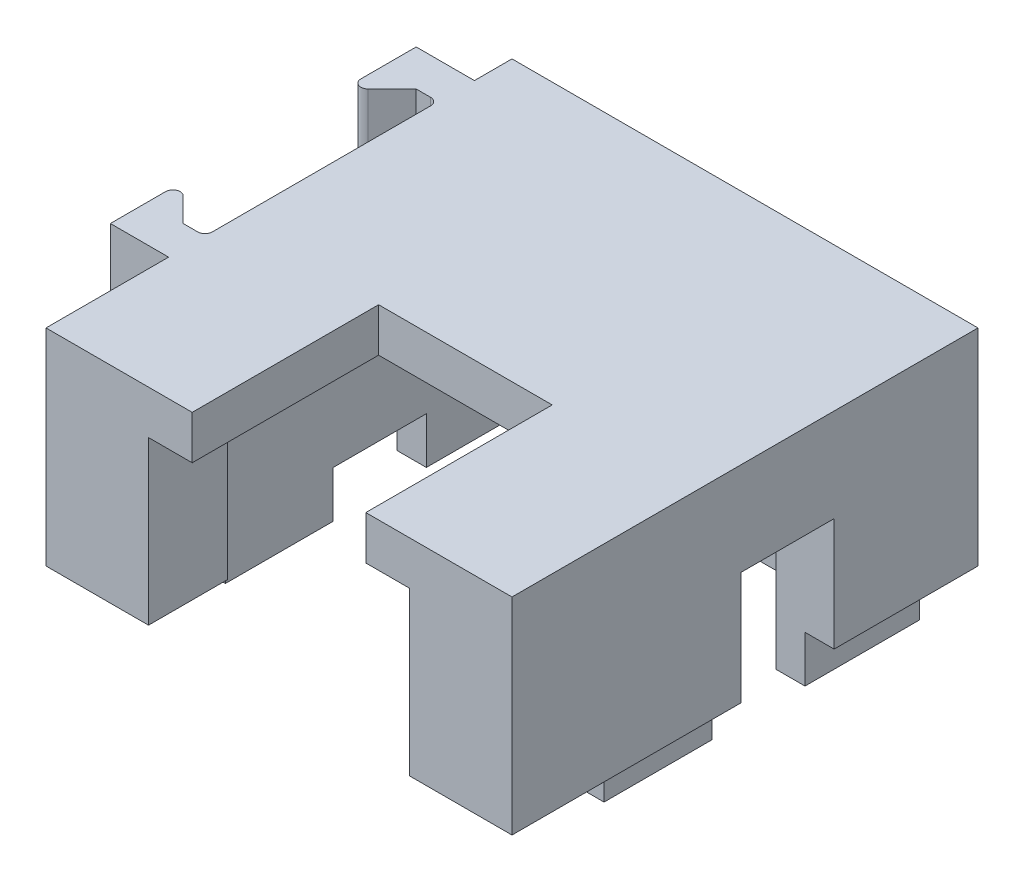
ISO-10303-21;
HEADER;
FILE_DESCRIPTION(('STEP AP214'),'2;1');
FILE_NAME('part.step','',(''),(''),'','','');
FILE_SCHEMA(('AUTOMOTIVE_DESIGN { 1 0 10303 214 1 1 1 1 }'));
ENDSEC;
DATA;
#1=APPLICATION_CONTEXT('core data for automotive mechanical design processes');
#2=APPLICATION_PROTOCOL_DEFINITION('international standard','automotive_design',2000,#1);
#3=PRODUCT_CONTEXT('',#1,'mechanical');
#4=PRODUCT('Part','Part','',(#3));
#5=PRODUCT_RELATED_PRODUCT_CATEGORY('part','',(#4));
#6=PRODUCT_DEFINITION_FORMATION('','',#4);
#7=PRODUCT_DEFINITION_CONTEXT('part definition',#1,'design');
#8=PRODUCT_DEFINITION('design','',#6,#7);
#9=PRODUCT_DEFINITION_SHAPE('','',#8);
#10=(LENGTH_UNIT() NAMED_UNIT(*) SI_UNIT(.MILLI.,.METRE.));
#11=(NAMED_UNIT(*) PLANE_ANGLE_UNIT() SI_UNIT($,.RADIAN.));
#12=(NAMED_UNIT(*) SI_UNIT($,.STERADIAN.) SOLID_ANGLE_UNIT());
#13=UNCERTAINTY_MEASURE_WITH_UNIT(LENGTH_MEASURE(1.E-05),#10,'distance_accuracy_value','');
#14=(GEOMETRIC_REPRESENTATION_CONTEXT(3) GLOBAL_UNCERTAINTY_ASSIGNED_CONTEXT((#13)) GLOBAL_UNIT_ASSIGNED_CONTEXT((#10,
#11,#12)) REPRESENTATION_CONTEXT('',''));
#15=CARTESIAN_POINT('',(0.,0.,0.));
#16=DIRECTION('',(0.,0.,1.));
#17=DIRECTION('',(1.,0.,0.));
#18=AXIS2_PLACEMENT_3D('',#15,#16,#17);
#19=CARTESIAN_POINT('',(-13.890625,16.3219798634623,-8.66775));
#20=DIRECTION('',(0.,0.,1.));
#21=DIRECTION('',(1.,0.,0.));
#22=AXIS2_PLACEMENT_3D('',#19,#20,#21);
#23=PLANE('',#22);
#24=CARTESIAN_POINT('',(-14.2875,5.74675,-8.66775));
#25=DIRECTION('',(0.,0.,1.));
#26=DIRECTION('',(1.,0.,0.));
#27=AXIS2_PLACEMENT_3D('',#24,#25,#26);
#28=CIRCLE('',#27,0.595629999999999);
#29=CARTESIAN_POINT('',(-13.890625,5.30260438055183,-8.66775));
#30=VERTEX_POINT('',#29);
#31=CARTESIAN_POINT('',(-13.890625,6.19089561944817,-8.66775));
#32=VERTEX_POINT('',#31);
#33=EDGE_CURVE('E61',#30,#32,#28,.T.);
#34=ORIENTED_EDGE('',*,*,#33,.F.);
#35=DIRECTION('',(0.,-1.,0.));
#36=VECTOR('',#35,1.);
#37=CARTESIAN_POINT('',(-13.890625,16.3219798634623,-8.66775));
#38=LINE('',#37,#36);
#39=CARTESIAN_POINT('',(-13.890625,0.254000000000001,-8.66775));
#40=VERTEX_POINT('',#39);
#41=EDGE_CURVE('E351',#30,#40,#38,.T.);
#42=ORIENTED_EDGE('',*,*,#41,.T.);
#43=DIRECTION('',(1.,0.,0.));
#44=VECTOR('',#43,1.);
#45=CARTESIAN_POINT('',(-13.890625,0.254000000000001,-8.66775));
#46=LINE('',#45,#44);
#47=CARTESIAN_POINT('',(-13.096875,0.254000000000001,-8.66775));
#48=VERTEX_POINT('',#47);
#49=EDGE_CURVE('E851',#40,#48,#46,.T.);
#50=ORIENTED_EDGE('',*,*,#49,.T.);
#51=DIRECTION('',(0.,-1.,0.));
#52=VECTOR('',#51,1.);
#53=CARTESIAN_POINT('',(-13.096875,16.3219798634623,-8.66775));
#54=LINE('',#53,#52);
#55=CARTESIAN_POINT('',(-13.096875,11.2395,-8.66775));
#56=VERTEX_POINT('',#55);
#57=EDGE_CURVE('E842',#48,#56,#54,.F.);
#58=ORIENTED_EDGE('',*,*,#57,.T.);
#59=DIRECTION('',(-1.,0.,0.));
#60=VECTOR('',#59,1.);
#61=CARTESIAN_POINT('',(-13.890625,11.2395,-8.66775));
#62=LINE('',#61,#60);
#63=CARTESIAN_POINT('',(-13.890625,11.2395,-8.66775));
#64=VERTEX_POINT('',#63);
#65=EDGE_CURVE('E361',#56,#64,#62,.T.);
#66=ORIENTED_EDGE('',*,*,#65,.T.);
#67=EDGE_CURVE('E353',#64,#32,#38,.T.);
#68=ORIENTED_EDGE('',*,*,#67,.T.);
#69=EDGE_LOOP('',(#34,#42,#50,#58,#66,#68));
#70=FACE_BOUND('',#69,.T.);
#71=ADVANCED_FACE('F48',(#70),#23,.T.);
#72=CARTESIAN_POINT('',(-15.875,16.3219798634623,-6.68337499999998));
#73=DIRECTION('',(0.707106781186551,0.,0.707106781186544));
#74=DIRECTION('',(0.707106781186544,0.,-0.707106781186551));
#75=AXIS2_PLACEMENT_3D('',#72,#73,#74);
#76=PLANE('',#75);
#77=CARTESIAN_POINT('',(-14.2875,5.74675,-8.270875));
#78=DIRECTION('',(0.707106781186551,0.,0.707106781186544));
#79=DIRECTION('',(0.707106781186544,0.,-0.707106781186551));
#80=AXIS2_PLACEMENT_3D('',#77,#78,#79);
#81=ELLIPSE('',#80,0.84234802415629,0.595629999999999);
#82=EDGE_CURVE('E13',#32,#30,#81,.T.);
#83=ORIENTED_EDGE('',*,*,#82,.F.);
#84=ORIENTED_EDGE('',*,*,#67,.F.);
#85=DIRECTION('',(-0.707106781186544,0.,0.707106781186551));
#86=VECTOR('',#85,1.);
#87=CARTESIAN_POINT('',(-15.875,11.2395,-6.68337499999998));
#88=LINE('',#87,#86);
#89=CARTESIAN_POINT('',(-15.1974919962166,11.2395,-7.3608830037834));
#90=VERTEX_POINT('',#89);
#91=EDGE_CURVE('E363',#64,#90,#88,.T.);
#92=ORIENTED_EDGE('',*,*,#91,.T.);
#93=DIRECTION('',(0.,-1.,0.));
#94=VECTOR('',#93,1.);
#95=CARTESIAN_POINT('',(-15.1974919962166,16.3219798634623,-7.3608830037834));
#96=LINE('',#95,#94);
#97=CARTESIAN_POINT('',(-15.1974919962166,0.254000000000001,-7.3608830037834));
#98=VERTEX_POINT('',#97);
#99=EDGE_CURVE('E673',#90,#98,#96,.T.);
#100=ORIENTED_EDGE('',*,*,#99,.T.);
#101=DIRECTION('',(0.707106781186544,0.,-0.707106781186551));
#102=VECTOR('',#101,1.);
#103=CARTESIAN_POINT('',(-15.875,0.254000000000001,-6.68337499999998));
#104=LINE('',#103,#102);
#105=EDGE_CURVE('E360',#98,#40,#104,.T.);
#106=ORIENTED_EDGE('',*,*,#105,.T.);
#107=ORIENTED_EDGE('',*,*,#41,.F.);
#108=EDGE_LOOP('',(#83,#84,#92,#100,#106,#107));
#109=FACE_BOUND('',#108,.T.);
#110=ADVANCED_FACE('F358',(#109),#76,.T.);
#111=CARTESIAN_POINT('',(-15.875,16.3219798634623,-10.652125));
#112=DIRECTION('',(-1.,0.,0.));
#113=DIRECTION('',(0.,0.,1.));
#114=AXIS2_PLACEMENT_3D('',#111,#112,#113);
#115=PLANE('',#114);
#116=DIRECTION('',(0.,-1.,0.));
#117=VECTOR('',#116,1.);
#118=CARTESIAN_POINT('',(-15.875,16.3219798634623,-10.652125));
#119=LINE('',#118,#117);
#120=CARTESIAN_POINT('',(-15.875,11.2395,-10.652125));
#121=VERTEX_POINT('',#120);
#122=CARTESIAN_POINT('',(-15.875,0.254,-10.652125));
#123=VERTEX_POINT('',#122);
#124=EDGE_CURVE('E368',#121,#123,#119,.T.);
#125=ORIENTED_EDGE('',*,*,#124,.T.);
#126=DIRECTION('',(0.,0.,-1.));
#127=VECTOR('',#126,1.);
#128=CARTESIAN_POINT('',(-15.875,0.254,-10.652125));
#129=LINE('',#128,#127);
#130=CARTESIAN_POINT('',(-15.875,0.254000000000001,-7.64151600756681));
#131=VERTEX_POINT('',#130);
#132=EDGE_CURVE('E1374',#131,#123,#129,.T.);
#133=ORIENTED_EDGE('',*,*,#132,.F.);
#134=DIRECTION('',(0.,-1.,0.));
#135=VECTOR('',#134,1.);
#136=CARTESIAN_POINT('',(-15.875,16.3219798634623,-7.64151600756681));
#137=LINE('',#136,#135);
#138=CARTESIAN_POINT('',(-15.875,11.2395,-7.64151600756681));
#139=VERTEX_POINT('',#138);
#140=EDGE_CURVE('E832',#131,#139,#137,.F.);
#141=ORIENTED_EDGE('',*,*,#140,.T.);
#142=DIRECTION('',(0.,0.,-1.));
#143=VECTOR('',#142,1.);
#144=CARTESIAN_POINT('',(-15.875,11.2395,-10.652125));
#145=LINE('',#144,#143);
#146=EDGE_CURVE('E819',#139,#121,#145,.T.);
#147=ORIENTED_EDGE('',*,*,#146,.T.);
#148=EDGE_LOOP('',(#125,#133,#141,#147));
#149=FACE_BOUND('',#148,.T.);
#150=ADVANCED_FACE('F961',(#149),#115,.T.);
#151=CARTESIAN_POINT('',(-12.7,16.3219798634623,-10.652125));
#152=DIRECTION('',(0.,0.,-1.));
#153=DIRECTION('',(-1.,0.,0.));
#154=AXIS2_PLACEMENT_3D('',#151,#152,#153);
#155=PLANE('',#154);
#156=CARTESIAN_POINT('',(-14.2875,5.74675,-10.652125));
#157=DIRECTION('',(0.,0.,-1.));
#158=DIRECTION('',(-1.,0.,0.));
#159=AXIS2_PLACEMENT_3D('',#156,#157,#158);
#160=CIRCLE('',#159,0.59563);
#161=CARTESIAN_POINT('',(-14.88313,5.74675,-10.652125));
#162=VERTEX_POINT('',#161);
#163=EDGE_CURVE('E355',#162,#162,#160,.T.);
#164=ORIENTED_EDGE('',*,*,#163,.F.);
#165=EDGE_LOOP('',(#164));
#166=FACE_BOUND('',#165,.T.);
#167=DIRECTION('',(0.,-1.,0.));
#168=VECTOR('',#167,1.);
#169=CARTESIAN_POINT('',(-12.7,16.3219798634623,-10.652125));
#170=LINE('',#169,#168);
#171=CARTESIAN_POINT('',(-12.7,11.2395,-10.652125));
#172=VERTEX_POINT('',#171);
#173=CARTESIAN_POINT('',(-12.7,0.254,-10.652125));
#174=VERTEX_POINT('',#173);
#175=EDGE_CURVE('E387',#172,#174,#170,.T.);
#176=ORIENTED_EDGE('',*,*,#175,.T.);
#177=DIRECTION('',(1.,0.,0.));
#178=VECTOR('',#177,1.);
#179=CARTESIAN_POINT('',(-12.7,0.254,-10.652125));
#180=LINE('',#179,#178);
#181=EDGE_CURVE('E1377',#123,#174,#180,.T.);
#182=ORIENTED_EDGE('',*,*,#181,.F.);
#183=ORIENTED_EDGE('',*,*,#124,.F.);
#184=DIRECTION('',(1.,0.,0.));
#185=VECTOR('',#184,1.);
#186=CARTESIAN_POINT('',(-12.7,11.2395,-10.652125));
#187=LINE('',#186,#185);
#188=EDGE_CURVE('E826',#121,#172,#187,.T.);
#189=ORIENTED_EDGE('',*,*,#188,.T.);
#190=EDGE_LOOP('',(#176,#182,#183,#189));
#191=FACE_BOUND('',#190,.T.);
#192=ADVANCED_FACE('F1038',(#166,#191),#155,.T.);
#193=CARTESIAN_POINT('',(-15.478125,16.3219798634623,-7.64151600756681));
#194=DIRECTION('',(0.,-1.,0.));
#195=DIRECTION('',(0.,0.,-1.));
#196=AXIS2_PLACEMENT_3D('',#193,#194,#195);
#197=CYLINDRICAL_SURFACE('',#196,0.396875);
#198=ORIENTED_EDGE('',*,*,#140,.F.);
#199=CARTESIAN_POINT('',(-15.478125,0.254000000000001,-7.64151600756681));
#200=DIRECTION('',(0.,-1.,0.));
#201=DIRECTION('',(0.,0.,-1.));
#202=AXIS2_PLACEMENT_3D('',#199,#200,#201);
#203=CIRCLE('',#202,0.396875);
#204=EDGE_CURVE('E818',#131,#98,#203,.F.);
#205=ORIENTED_EDGE('',*,*,#204,.T.);
#206=ORIENTED_EDGE('',*,*,#99,.F.);
#207=CARTESIAN_POINT('',(-15.478125,11.2395,-7.64151600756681));
#208=DIRECTION('',(0.,1.,0.));
#209=DIRECTION('',(0.,0.,1.));
#210=AXIS2_PLACEMENT_3D('',#207,#208,#209);
#211=CIRCLE('',#210,0.396875);
#212=EDGE_CURVE('E833',#139,#90,#211,.T.);
#213=ORIENTED_EDGE('',*,*,#212,.F.);
#214=EDGE_LOOP('',(#198,#205,#206,#213));
#215=FACE_BOUND('',#214,.T.);
#216=ADVANCED_FACE('F563',(#215),#197,.T.);
#217=CARTESIAN_POINT('',(-13.096875,11.2395,-8.270875));
#218=DIRECTION('',(0.,-1.,0.));
#219=DIRECTION('',(0.,0.,-1.));
#220=AXIS2_PLACEMENT_3D('',#217,#218,#219);
#221=CYLINDRICAL_SURFACE('',#220,0.396875);
#222=CARTESIAN_POINT('',(-13.096875,0.254000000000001,-8.270875));
#223=DIRECTION('',(0.,-1.,0.));
#224=DIRECTION('',(0.,0.,-1.));
#225=AXIS2_PLACEMENT_3D('',#222,#223,#224);
#226=CIRCLE('',#225,0.396875);
#227=CARTESIAN_POINT('',(-12.7,0.254000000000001,-8.270875));
#228=VERTEX_POINT('',#227);
#229=EDGE_CURVE('E850',#228,#48,#226,.F.);
#230=ORIENTED_EDGE('',*,*,#229,.F.);
#231=DIRECTION('',(0.,-1.,0.));
#232=VECTOR('',#231,1.);
#233=CARTESIAN_POINT('',(-12.7,11.2395,-8.270875));
#234=LINE('',#233,#232);
#235=CARTESIAN_POINT('',(-12.7,11.2395,-8.270875));
#236=VERTEX_POINT('',#235);
#237=EDGE_CURVE('E838',#236,#228,#234,.T.);
#238=ORIENTED_EDGE('',*,*,#237,.F.);
#239=CARTESIAN_POINT('',(-13.096875,11.2395,-8.270875));
#240=DIRECTION('',(0.,1.,0.));
#241=DIRECTION('',(0.,0.,1.));
#242=AXIS2_PLACEMENT_3D('',#239,#240,#241);
#243=CIRCLE('',#242,0.396875);
#244=EDGE_CURVE('E765',#56,#236,#243,.F.);
#245=ORIENTED_EDGE('',*,*,#244,.F.);
#246=ORIENTED_EDGE('',*,*,#57,.F.);
#247=EDGE_LOOP('',(#230,#238,#245,#246));
#248=FACE_BOUND('',#247,.T.);
#249=ADVANCED_FACE('F849',(#248),#221,.F.);
#250=CARTESIAN_POINT('',(-13.890625,16.3219798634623,4.03225));
#251=DIRECTION('',(0.,0.,1.));
#252=DIRECTION('',(1.,0.,0.));
#253=AXIS2_PLACEMENT_3D('',#250,#251,#252);
#254=PLANE('',#253);
#255=DIRECTION('',(1.,0.,0.));
#256=VECTOR('',#255,1.);
#257=CARTESIAN_POINT('',(-13.890625,0.254000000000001,4.03225));
#258=LINE('',#257,#256);
#259=CARTESIAN_POINT('',(-13.890625,0.254000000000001,4.03225));
#260=VERTEX_POINT('',#259);
#261=CARTESIAN_POINT('',(-13.096875,0.254000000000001,4.03225));
#262=VERTEX_POINT('',#261);
#263=EDGE_CURVE('E786',#260,#262,#258,.T.);
#264=ORIENTED_EDGE('',*,*,#263,.F.);
#265=DIRECTION('',(0.,-1.,0.));
#266=VECTOR('',#265,1.);
#267=CARTESIAN_POINT('',(-13.890625,16.3219798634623,4.03225));
#268=LINE('',#267,#266);
#269=CARTESIAN_POINT('',(-13.890625,11.2395,4.03225));
#270=VERTEX_POINT('',#269);
#271=EDGE_CURVE('E805',#270,#260,#268,.T.);
#272=ORIENTED_EDGE('',*,*,#271,.F.);
#273=DIRECTION('',(-1.,0.,0.));
#274=VECTOR('',#273,1.);
#275=CARTESIAN_POINT('',(-13.890625,11.2395,4.03225));
#276=LINE('',#275,#274);
#277=CARTESIAN_POINT('',(-13.096875,11.2395,4.03225));
#278=VERTEX_POINT('',#277);
#279=EDGE_CURVE('E799',#278,#270,#276,.T.);
#280=ORIENTED_EDGE('',*,*,#279,.F.);
#281=DIRECTION('',(0.,-1.,0.));
#282=VECTOR('',#281,1.);
#283=CARTESIAN_POINT('',(-13.096875,0.,4.03225));
#284=LINE('',#283,#282);
#285=EDGE_CURVE('E774',#278,#262,#284,.T.);
#286=ORIENTED_EDGE('',*,*,#285,.T.);
#287=EDGE_LOOP('',(#264,#272,#280,#286));
#288=FACE_BOUND('',#287,.T.);
#289=ADVANCED_FACE('F803',(#288),#254,.F.);
#290=CARTESIAN_POINT('',(-15.875,16.3219798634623,2.04787499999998));
#291=DIRECTION('',(-0.707106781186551,0.,0.707106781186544));
#292=DIRECTION('',(0.707106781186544,0.,0.707106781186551));
#293=AXIS2_PLACEMENT_3D('',#290,#291,#292);
#294=PLANE('',#293);
#295=DIRECTION('',(0.707106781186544,0.,0.707106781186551));
#296=VECTOR('',#295,1.);
#297=CARTESIAN_POINT('',(-15.875,0.254000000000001,2.04787499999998));
#298=LINE('',#297,#296);
#299=CARTESIAN_POINT('',(-15.1974919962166,0.254000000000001,2.7253830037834));
#300=VERTEX_POINT('',#299);
#301=EDGE_CURVE('E856',#300,#260,#298,.T.);
#302=ORIENTED_EDGE('',*,*,#301,.F.);
#303=DIRECTION('',(0.,-1.,0.));
#304=VECTOR('',#303,1.);
#305=CARTESIAN_POINT('',(-15.1974919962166,16.3219798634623,2.7253830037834));
#306=LINE('',#305,#304);
#307=CARTESIAN_POINT('',(-15.1974919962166,11.2395,2.7253830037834));
#308=VERTEX_POINT('',#307);
#309=EDGE_CURVE('E770',#300,#308,#306,.F.);
#310=ORIENTED_EDGE('',*,*,#309,.T.);
#311=DIRECTION('',(-0.707106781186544,0.,-0.707106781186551));
#312=VECTOR('',#311,1.);
#313=CARTESIAN_POINT('',(-15.875,11.2395,2.04787499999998));
#314=LINE('',#313,#312);
#315=EDGE_CURVE('E806',#270,#308,#314,.T.);
#316=ORIENTED_EDGE('',*,*,#315,.F.);
#317=ORIENTED_EDGE('',*,*,#271,.T.);
#318=EDGE_LOOP('',(#302,#310,#316,#317));
#319=FACE_BOUND('',#318,.T.);
#320=ADVANCED_FACE('F1339',(#319),#294,.F.);
#321=CARTESIAN_POINT('',(-15.875,16.3219798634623,6.01662499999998));
#322=DIRECTION('',(1.,0.,0.));
#323=DIRECTION('',(0.,0.,-1.));
#324=AXIS2_PLACEMENT_3D('',#321,#322,#323);
#325=PLANE('',#324);
#326=CARTESIAN_POINT('',(-15.875,0.254,6.01662499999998));
#327=VERTEX_POINT('',#326);
#328=CARTESIAN_POINT('',(-15.875,0.254000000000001,3.00601600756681));
#329=VERTEX_POINT('',#328);
#330=EDGE_CURVE('E870',#327,#329,#129,.T.);
#331=ORIENTED_EDGE('',*,*,#330,.F.);
#332=DIRECTION('',(0.,-1.,0.));
#333=VECTOR('',#332,1.);
#334=CARTESIAN_POINT('',(-15.875,16.3219798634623,6.01662499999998));
#335=LINE('',#334,#333);
#336=CARTESIAN_POINT('',(-15.875,11.2395,6.01662499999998));
#337=VERTEX_POINT('',#336);
#338=EDGE_CURVE('E810',#337,#327,#335,.T.);
#339=ORIENTED_EDGE('',*,*,#338,.F.);
#340=DIRECTION('',(0.,0.,1.));
#341=VECTOR('',#340,1.);
#342=CARTESIAN_POINT('',(-15.875,11.2395,6.01662499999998));
#343=LINE('',#342,#341);
#344=CARTESIAN_POINT('',(-15.875,11.2395,3.00601600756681));
#345=VERTEX_POINT('',#344);
#346=EDGE_CURVE('E364',#345,#337,#343,.T.);
#347=ORIENTED_EDGE('',*,*,#346,.F.);
#348=DIRECTION('',(0.,-1.,0.));
#349=VECTOR('',#348,1.);
#350=CARTESIAN_POINT('',(-15.875,16.3219798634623,3.00601600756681));
#351=LINE('',#350,#349);
#352=EDGE_CURVE('E767',#345,#329,#351,.T.);
#353=ORIENTED_EDGE('',*,*,#352,.T.);
#354=EDGE_LOOP('',(#331,#339,#347,#353));
#355=FACE_BOUND('',#354,.T.);
#356=ADVANCED_FACE('F869',(#355),#325,.F.);
#357=CARTESIAN_POINT('',(-12.7,16.3219798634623,6.01662499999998));
#358=DIRECTION('',(0.,0.,-1.));
#359=DIRECTION('',(-1.,0.,0.));
#360=AXIS2_PLACEMENT_3D('',#357,#358,#359);
#361=PLANE('',#360);
#362=DIRECTION('',(-1.,0.,0.));
#363=VECTOR('',#362,1.);
#364=CARTESIAN_POINT('',(-12.7,0.254,6.01662499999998));
#365=LINE('',#364,#363);
#366=CARTESIAN_POINT('',(-12.7,0.254,6.01662499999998));
#367=VERTEX_POINT('',#366);
#368=EDGE_CURVE('E873',#367,#327,#365,.T.);
#369=ORIENTED_EDGE('',*,*,#368,.F.);
#370=DIRECTION('',(0.,-1.,0.));
#371=VECTOR('',#370,1.);
#372=CARTESIAN_POINT('',(-12.7,16.3219798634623,6.01662499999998));
#373=LINE('',#372,#371);
#374=CARTESIAN_POINT('',(-12.7,11.2395,6.01662499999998));
#375=VERTEX_POINT('',#374);
#376=EDGE_CURVE('E795',#375,#367,#373,.T.);
#377=ORIENTED_EDGE('',*,*,#376,.F.);
#378=DIRECTION('',(1.,0.,0.));
#379=VECTOR('',#378,1.);
#380=CARTESIAN_POINT('',(-12.7,11.2395,6.01662499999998));
#381=LINE('',#380,#379);
#382=EDGE_CURVE('E807',#337,#375,#381,.T.);
#383=ORIENTED_EDGE('',*,*,#382,.F.);
#384=ORIENTED_EDGE('',*,*,#338,.T.);
#385=EDGE_LOOP('',(#369,#377,#383,#384));
#386=FACE_BOUND('',#385,.T.);
#387=ADVANCED_FACE('F872',(#386),#361,.F.);
#388=CARTESIAN_POINT('',(-15.478125,16.3219798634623,3.00601600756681));
#389=DIRECTION('',(0.,-1.,0.));
#390=DIRECTION('',(0.,0.,-1.));
#391=AXIS2_PLACEMENT_3D('',#388,#389,#390);
#392=CYLINDRICAL_SURFACE('',#391,0.396875);
#393=ORIENTED_EDGE('',*,*,#309,.F.);
#394=CARTESIAN_POINT('',(-15.478125,0.254000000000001,3.00601600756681));
#395=DIRECTION('',(0.,-1.,0.));
#396=DIRECTION('',(0.,0.,-1.));
#397=AXIS2_PLACEMENT_3D('',#394,#395,#396);
#398=CIRCLE('',#397,0.396875);
#399=EDGE_CURVE('E852',#300,#329,#398,.F.);
#400=ORIENTED_EDGE('',*,*,#399,.T.);
#401=ORIENTED_EDGE('',*,*,#352,.F.);
#402=CARTESIAN_POINT('',(-15.478125,11.2395,3.00601600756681));
#403=DIRECTION('',(0.,1.,0.));
#404=DIRECTION('',(0.,0.,1.));
#405=AXIS2_PLACEMENT_3D('',#402,#403,#404);
#406=CIRCLE('',#405,0.396875);
#407=EDGE_CURVE('E772',#308,#345,#406,.T.);
#408=ORIENTED_EDGE('',*,*,#407,.F.);
#409=EDGE_LOOP('',(#393,#400,#401,#408));
#410=FACE_BOUND('',#409,.T.);
#411=ADVANCED_FACE('F1320',(#410),#392,.T.);
#412=CARTESIAN_POINT('',(-13.096875,16.3219798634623,3.635375));
#413=DIRECTION('',(0.,1.,0.));
#414=DIRECTION('',(0.,0.,1.));
#415=AXIS2_PLACEMENT_3D('',#412,#413,#414);
#416=CYLINDRICAL_SURFACE('',#415,0.396875);
#417=CARTESIAN_POINT('',(-13.096875,0.254000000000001,3.635375));
#418=DIRECTION('',(0.,-1.,0.));
#419=DIRECTION('',(0.,0.,-1.));
#420=AXIS2_PLACEMENT_3D('',#417,#418,#419);
#421=CIRCLE('',#420,0.396875);
#422=CARTESIAN_POINT('',(-12.7,0.254000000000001,3.635375));
#423=VERTEX_POINT('',#422);
#424=EDGE_CURVE('E56',#262,#423,#421,.F.);
#425=ORIENTED_EDGE('',*,*,#424,.F.);
#426=ORIENTED_EDGE('',*,*,#285,.F.);
#427=CARTESIAN_POINT('',(-13.096875,11.2395,3.635375));
#428=DIRECTION('',(0.,1.,0.));
#429=DIRECTION('',(0.,0.,1.));
#430=AXIS2_PLACEMENT_3D('',#427,#428,#429);
#431=CIRCLE('',#430,0.396875);
#432=CARTESIAN_POINT('',(-12.7,11.2395,3.635375));
#433=VERTEX_POINT('',#432);
#434=EDGE_CURVE('E779',#433,#278,#431,.F.);
#435=ORIENTED_EDGE('',*,*,#434,.F.);
#436=DIRECTION('',(0.,-1.,0.));
#437=VECTOR('',#436,1.);
#438=CARTESIAN_POINT('',(-12.7,11.2395,3.635375));
#439=LINE('',#438,#437);
#440=EDGE_CURVE('E777',#423,#433,#439,.F.);
#441=ORIENTED_EDGE('',*,*,#440,.F.);
#442=EDGE_LOOP('',(#425,#426,#435,#441));
#443=FACE_BOUND('',#442,.T.);
#444=ADVANCED_FACE('F50',(#443),#416,.F.);
#445=CARTESIAN_POINT('',(-12.7,11.2395,-12.7));
#446=DIRECTION('',(1.,0.,0.));
#447=DIRECTION('',(0.,0.,-1.));
#448=AXIS2_PLACEMENT_3D('',#445,#446,#447);
#449=PLANE('',#448);
#450=ORIENTED_EDGE('',*,*,#175,.F.);
#451=DIRECTION('',(0.,0.,1.));
#452=VECTOR('',#451,1.);
#453=CARTESIAN_POINT('',(-12.7,11.2395,-12.7));
#454=LINE('',#453,#452);
#455=CARTESIAN_POINT('',(-12.7,11.2395,-12.7));
#456=VERTEX_POINT('',#455);
#457=EDGE_CURVE('E681',#456,#172,#454,.T.);
#458=ORIENTED_EDGE('',*,*,#457,.F.);
#459=DIRECTION('',(0.,-1.,0.));
#460=VECTOR('',#459,1.);
#461=CARTESIAN_POINT('',(-12.7,11.2395,-12.7));
#462=LINE('',#461,#460);
#463=CARTESIAN_POINT('',(-12.7,0.,-12.7));
#464=VERTEX_POINT('',#463);
#465=EDGE_CURVE('E699',#456,#464,#462,.T.);
#466=ORIENTED_EDGE('',*,*,#465,.T.);
#467=DIRECTION('',(0.,0.,1.));
#468=VECTOR('',#467,1.);
#469=CARTESIAN_POINT('',(-12.7,0.,-12.7));
#470=LINE('',#469,#468);
#471=CARTESIAN_POINT('',(-12.7,0.,12.7));
#472=VERTEX_POINT('',#471);
#473=EDGE_CURVE('E676',#464,#472,#470,.T.);
#474=ORIENTED_EDGE('',*,*,#473,.T.);
#475=DIRECTION('',(0.,-1.,0.));
#476=VECTOR('',#475,1.);
#477=CARTESIAN_POINT('',(-12.7,11.2395,12.7));
#478=LINE('',#477,#476);
#479=CARTESIAN_POINT('',(-12.7,11.2395,12.7));
#480=VERTEX_POINT('',#479);
#481=EDGE_CURVE('E695',#480,#472,#478,.T.);
#482=ORIENTED_EDGE('',*,*,#481,.F.);
#483=EDGE_CURVE('E718',#375,#480,#454,.T.);
#484=ORIENTED_EDGE('',*,*,#483,.F.);
#485=ORIENTED_EDGE('',*,*,#376,.T.);
#486=DIRECTION('',(0.,0.,1.));
#487=VECTOR('',#486,1.);
#488=CARTESIAN_POINT('',(-12.7,0.254,-10.652125));
#489=LINE('',#488,#487);
#490=EDGE_CURVE('E354',#423,#367,#489,.T.);
#491=ORIENTED_EDGE('',*,*,#490,.F.);
#492=ORIENTED_EDGE('',*,*,#440,.T.);
#493=EDGE_CURVE('E760',#236,#433,#454,.T.);
#494=ORIENTED_EDGE('',*,*,#493,.F.);
#495=ORIENTED_EDGE('',*,*,#237,.T.);
#496=EDGE_CURVE('E69',#174,#228,#489,.T.);
#497=ORIENTED_EDGE('',*,*,#496,.F.);
#498=EDGE_LOOP('',(#450,#458,#466,#474,#482,#484,#485,#491,#492,#494,#495,#497));
#499=FACE_BOUND('',#498,.T.);
#500=ADVANCED_FACE('F551',(#499),#449,.F.);
#501=CARTESIAN_POINT('',(0.,-2.54,0.));
#502=DIRECTION('',(0.,-1.,0.));
#503=DIRECTION('',(0.,0.,-1.));
#504=AXIS2_PLACEMENT_3D('',#501,#502,#503);
#505=PLANE('',#504);
#506=DIRECTION('',(-1.,0.,0.));
#507=VECTOR('',#506,1.);
#508=CARTESIAN_POINT('',(-3.84538733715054,-2.54,-4.85775));
#509=LINE('',#508,#507);
#510=CARTESIAN_POINT('',(-9.525,-2.54,-4.85775));
#511=VERTEX_POINT('',#510);
#512=CARTESIAN_POINT('',(-11.1125,-2.54,-4.85775));
#513=VERTEX_POINT('',#512);
#514=EDGE_CURVE('E384',#511,#513,#509,.T.);
#515=ORIENTED_EDGE('',*,*,#514,.T.);
#516=DIRECTION('',(0.,0.,-1.));
#517=VECTOR('',#516,1.);
#518=CARTESIAN_POINT('',(-11.1125,-2.54,0.));
#519=LINE('',#518,#517);
#520=CARTESIAN_POINT('',(-11.1125,-2.54,-11.1125));
#521=VERTEX_POINT('',#520);
#522=EDGE_CURVE('E628',#513,#521,#519,.T.);
#523=ORIENTED_EDGE('',*,*,#522,.T.);
#524=DIRECTION('',(-1.,0.,0.));
#525=VECTOR('',#524,1.);
#526=CARTESIAN_POINT('',(0.,-2.54,-11.1125));
#527=LINE('',#526,#525);
#528=CARTESIAN_POINT('',(11.1125,-2.54,-11.1125));
#529=VERTEX_POINT('',#528);
#530=EDGE_CURVE('E632',#529,#521,#527,.T.);
#531=ORIENTED_EDGE('',*,*,#530,.F.);
#532=DIRECTION('',(0.,0.,-1.));
#533=VECTOR('',#532,1.);
#534=CARTESIAN_POINT('',(11.1125,-2.54,0.));
#535=LINE('',#534,#533);
#536=CARTESIAN_POINT('',(11.1125,-2.54,-4.85775000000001));
#537=VERTEX_POINT('',#536);
#538=EDGE_CURVE('E635',#537,#529,#535,.T.);
#539=ORIENTED_EDGE('',*,*,#538,.F.);
#540=DIRECTION('',(1.,0.,0.));
#541=VECTOR('',#540,1.);
#542=CARTESIAN_POINT('',(0.,-2.54,-4.85775000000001));
#543=LINE('',#542,#541);
#544=CARTESIAN_POINT('',(9.525,-2.54,-4.85775000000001));
#545=VERTEX_POINT('',#544);
#546=EDGE_CURVE('E571',#537,#545,#543,.F.);
#547=ORIENTED_EDGE('',*,*,#546,.T.);
#548=DIRECTION('',(0.,0.,-1.));
#549=VECTOR('',#548,1.);
#550=CARTESIAN_POINT('',(9.525,-2.54,0.));
#551=LINE('',#550,#549);
#552=CARTESIAN_POINT('',(9.525,-2.54,-9.525));
#553=VERTEX_POINT('',#552);
#554=EDGE_CURVE('E614',#545,#553,#551,.T.);
#555=ORIENTED_EDGE('',*,*,#554,.T.);
#556=DIRECTION('',(-1.,0.,0.));
#557=VECTOR('',#556,1.);
#558=CARTESIAN_POINT('',(0.,-2.54,-9.525));
#559=LINE('',#558,#557);
#560=CARTESIAN_POINT('',(-9.525,-2.54,-9.525));
#561=VERTEX_POINT('',#560);
#562=EDGE_CURVE('E618',#553,#561,#559,.T.);
#563=ORIENTED_EDGE('',*,*,#562,.T.);
#564=DIRECTION('',(0.,0.,1.));
#565=VECTOR('',#564,1.);
#566=CARTESIAN_POINT('',(-9.525,-2.54,0.));
#567=LINE('',#566,#565);
#568=EDGE_CURVE('E622',#561,#511,#567,.T.);
#569=ORIENTED_EDGE('',*,*,#568,.T.);
#570=EDGE_LOOP('',(#515,#523,#531,#539,#547,#555,#563,#569));
#571=FACE_BOUND('',#570,.T.);
#572=ADVANCED_FACE('F485',(#571),#505,.T.);
#573=CARTESIAN_POINT('',(-11.1125,-2.54,0.));
#574=DIRECTION('',(1.,0.,0.));
#575=DIRECTION('',(0.,0.,-1.));
#576=AXIS2_PLACEMENT_3D('',#573,#574,#575);
#577=PLANE('',#576);
#578=ORIENTED_EDGE('',*,*,#522,.F.);
#579=DIRECTION('',(0.,1.,0.));
#580=VECTOR('',#579,1.);
#581=CARTESIAN_POINT('',(-11.1125,-2.54,-4.85775));
#582=LINE('',#581,#580);
#583=CARTESIAN_POINT('',(-11.1125,0.,-4.85775));
#584=VERTEX_POINT('',#583);
#585=EDGE_CURVE('E669',#513,#584,#582,.T.);
#586=ORIENTED_EDGE('',*,*,#585,.T.);
#587=DIRECTION('',(0.,0.,-1.));
#588=VECTOR('',#587,1.);
#589=CARTESIAN_POINT('',(-11.1125,0.,0.));
#590=LINE('',#589,#588);
#591=CARTESIAN_POINT('',(-11.1125,0.,-11.1125));
#592=VERTEX_POINT('',#591);
#593=EDGE_CURVE('E647',#584,#592,#590,.T.);
#594=ORIENTED_EDGE('',*,*,#593,.T.);
#595=DIRECTION('',(0.,1.,0.));
#596=VECTOR('',#595,1.);
#597=CARTESIAN_POINT('',(-11.1125,-2.54,-11.1125));
#598=LINE('',#597,#596);
#599=EDGE_CURVE('E915',#521,#592,#598,.T.);
#600=ORIENTED_EDGE('',*,*,#599,.F.);
#601=EDGE_LOOP('',(#578,#586,#594,#600));
#602=FACE_BOUND('',#601,.T.);
#603=ADVANCED_FACE('F500',(#602),#577,.F.);
#604=CARTESIAN_POINT('',(0.,8.85825,0.));
#605=DIRECTION('',(0.,1.,0.));
#606=DIRECTION('',(0.,0.,1.));
#607=AXIS2_PLACEMENT_3D('',#604,#605,#606);
#608=PLANE('',#607);
#609=DIRECTION('',(1.,0.,0.));
#610=VECTOR('',#609,1.);
#611=CARTESIAN_POINT('',(9.525,8.85825,8.382));
#612=LINE('',#611,#610);
#613=CARTESIAN_POINT('',(7.11200000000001,8.85825,8.382));
#614=VERTEX_POINT('',#613);
#615=CARTESIAN_POINT('',(9.525,8.85825,8.382));
#616=VERTEX_POINT('',#615);
#617=EDGE_CURVE('E396',#614,#616,#612,.T.);
#618=ORIENTED_EDGE('',*,*,#617,.F.);
#619=DIRECTION('',(0.,0.,-1.));
#620=VECTOR('',#619,1.);
#621=CARTESIAN_POINT('',(7.112,8.85825,16.0675960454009));
#622=LINE('',#621,#620);
#623=CARTESIAN_POINT('',(7.11200000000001,8.85825,12.7));
#624=VERTEX_POINT('',#623);
#625=EDGE_CURVE('E417',#624,#614,#622,.T.);
#626=ORIENTED_EDGE('',*,*,#625,.F.);
#627=DIRECTION('',(-1.,0.,0.));
#628=VECTOR('',#627,1.);
#629=CARTESIAN_POINT('',(7.112,8.85825,12.7));
#630=LINE('',#629,#628);
#631=CARTESIAN_POINT('',(4.73075,8.85825,12.7));
#632=VERTEX_POINT('',#631);
#633=EDGE_CURVE('E414',#624,#632,#630,.T.);
#634=ORIENTED_EDGE('',*,*,#633,.T.);
#635=DIRECTION('',(0.,0.,-1.));
#636=VECTOR('',#635,1.);
#637=CARTESIAN_POINT('',(4.73075,8.85825,16.0675960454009));
#638=LINE('',#637,#636);
#639=CARTESIAN_POINT('',(4.73075,8.85825,2.54));
#640=VERTEX_POINT('',#639);
#641=EDGE_CURVE('E419',#632,#640,#638,.T.);
#642=ORIENTED_EDGE('',*,*,#641,.T.);
#643=DIRECTION('',(-1.,0.,0.));
#644=VECTOR('',#643,1.);
#645=CARTESIAN_POINT('',(0.,8.85825,2.54));
#646=LINE('',#645,#644);
#647=CARTESIAN_POINT('',(-4.73075,8.85825,2.54));
#648=VERTEX_POINT('',#647);
#649=EDGE_CURVE('E580',#640,#648,#646,.T.);
#650=ORIENTED_EDGE('',*,*,#649,.T.);
#651=DIRECTION('',(0.,0.,-1.));
#652=VECTOR('',#651,1.);
#653=CARTESIAN_POINT('',(-4.73075,8.85825,16.0675960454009));
#654=LINE('',#653,#652);
#655=CARTESIAN_POINT('',(-4.73075,8.85825,12.7));
#656=VERTEX_POINT('',#655);
#657=EDGE_CURVE('E439',#656,#648,#654,.T.);
#658=ORIENTED_EDGE('',*,*,#657,.F.);
#659=DIRECTION('',(-1.,0.,0.));
#660=VECTOR('',#659,1.);
#661=CARTESIAN_POINT('',(-7.112,8.85825,12.7));
#662=LINE('',#661,#660);
#663=CARTESIAN_POINT('',(-7.112,8.85825,12.7));
#664=VERTEX_POINT('',#663);
#665=EDGE_CURVE('E430',#656,#664,#662,.T.);
#666=ORIENTED_EDGE('',*,*,#665,.T.);
#667=DIRECTION('',(0.,0.,-1.));
#668=VECTOR('',#667,1.);
#669=CARTESIAN_POINT('',(-7.112,8.85825,16.0675960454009));
#670=LINE('',#669,#668);
#671=CARTESIAN_POINT('',(-7.112,8.85825,8.382));
#672=VERTEX_POINT('',#671);
#673=EDGE_CURVE('E431',#664,#672,#670,.T.);
#674=ORIENTED_EDGE('',*,*,#673,.T.);
#675=DIRECTION('',(1.,0.,0.));
#676=VECTOR('',#675,1.);
#677=CARTESIAN_POINT('',(-7.112,8.85825,8.382));
#678=LINE('',#677,#676);
#679=CARTESIAN_POINT('',(-9.525,8.85825,8.382));
#680=VERTEX_POINT('',#679);
#681=EDGE_CURVE('E406',#680,#672,#678,.T.);
#682=ORIENTED_EDGE('',*,*,#681,.F.);
#683=DIRECTION('',(0.,0.,-1.));
#684=VECTOR('',#683,1.);
#685=CARTESIAN_POINT('',(-9.525,8.85825,-9.525));
#686=LINE('',#685,#684);
#687=CARTESIAN_POINT('',(-9.525,8.85825,-9.525));
#688=VERTEX_POINT('',#687);
#689=EDGE_CURVE('E736',#680,#688,#686,.T.);
#690=ORIENTED_EDGE('',*,*,#689,.T.);
#691=DIRECTION('',(1.,0.,0.));
#692=VECTOR('',#691,1.);
#693=CARTESIAN_POINT('',(-9.525,8.85825,-9.525));
#694=LINE('',#693,#692);
#695=CARTESIAN_POINT('',(9.525,8.85825,-9.525));
#696=VERTEX_POINT('',#695);
#697=EDGE_CURVE('E744',#688,#696,#694,.T.);
#698=ORIENTED_EDGE('',*,*,#697,.T.);
#699=DIRECTION('',(0.,0.,1.));
#700=VECTOR('',#699,1.);
#701=CARTESIAN_POINT('',(9.525,8.85825,-9.525));
#702=LINE('',#701,#700);
#703=EDGE_CURVE('E751',#696,#616,#702,.T.);
#704=ORIENTED_EDGE('',*,*,#703,.T.);
#705=EDGE_LOOP('',(#618,#626,#634,#642,#650,#658,#666,#674,#682,#690,#698,#704));
#706=FACE_BOUND('',#705,.T.);
#707=ADVANCED_FACE('F525',(#706),#608,.F.);
#708=CARTESIAN_POINT('',(9.525,38.1802683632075,-9.525));
#709=DIRECTION('',(1.,0.,0.));
#710=DIRECTION('',(0.,0.,-1.));
#711=AXIS2_PLACEMENT_3D('',#708,#709,#710);
#712=PLANE('',#711);
#713=DIRECTION('',(0.,-1.,0.));
#714=VECTOR('',#713,1.);
#715=CARTESIAN_POINT('',(9.525,0.,8.382));
#716=LINE('',#715,#714);
#717=CARTESIAN_POINT('',(9.525,0.,8.382));
#718=VERTEX_POINT('',#717);
#719=EDGE_CURVE('E377',#616,#718,#716,.T.);
#720=ORIENTED_EDGE('',*,*,#719,.F.);
#721=ORIENTED_EDGE('',*,*,#703,.F.);
#722=DIRECTION('',(0.,-1.,0.));
#723=VECTOR('',#722,1.);
#724=CARTESIAN_POINT('',(9.525,38.1802683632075,-9.525));
#725=LINE('',#724,#723);
#726=EDGE_CURVE('E749',#696,#553,#725,.T.);
#727=ORIENTED_EDGE('',*,*,#726,.T.);
#728=ORIENTED_EDGE('',*,*,#554,.F.);
#729=DIRECTION('',(0.,-1.,0.));
#730=VECTOR('',#729,1.);
#731=CARTESIAN_POINT('',(9.525,38.1802683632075,-4.85774999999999));
#732=LINE('',#731,#730);
#733=CARTESIAN_POINT('',(9.525,4.0976308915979,-4.85775));
#734=VERTEX_POINT('',#733);
#735=EDGE_CURVE('E600',#734,#545,#732,.T.);
#736=ORIENTED_EDGE('',*,*,#735,.F.);
#737=DIRECTION('',(0.,0.,-1.));
#738=VECTOR('',#737,1.);
#739=CARTESIAN_POINT('',(9.525,4.0976308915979,-9.525));
#740=LINE('',#739,#738);
#741=CARTESIAN_POINT('',(9.525,4.09763089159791,0.222249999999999));
#742=VERTEX_POINT('',#741);
#743=EDGE_CURVE('E582',#742,#734,#740,.T.);
#744=ORIENTED_EDGE('',*,*,#743,.F.);
#745=DIRECTION('',(0.,-1.,0.));
#746=VECTOR('',#745,1.);
#747=CARTESIAN_POINT('',(9.525,38.1802683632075,0.222250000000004));
#748=LINE('',#747,#746);
#749=CARTESIAN_POINT('',(9.525,-2.54,0.222249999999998));
#750=VERTEX_POINT('',#749);
#751=EDGE_CURVE('E607',#742,#750,#748,.T.);
#752=ORIENTED_EDGE('',*,*,#751,.T.);
#753=CARTESIAN_POINT('',(9.525,-2.54,6.096));
#754=VERTEX_POINT('',#753);
#755=EDGE_CURVE('E617',#754,#750,#551,.T.);
#756=ORIENTED_EDGE('',*,*,#755,.F.);
#757=DIRECTION('',(0.,1.,0.));
#758=VECTOR('',#757,1.);
#759=CARTESIAN_POINT('',(9.525,-2.54,6.096));
#760=LINE('',#759,#758);
#761=CARTESIAN_POINT('',(9.525,0.,6.096));
#762=VERTEX_POINT('',#761);
#763=EDGE_CURVE('E654',#754,#762,#760,.T.);
#764=ORIENTED_EDGE('',*,*,#763,.T.);
#765=DIRECTION('',(0.,0.,1.));
#766=VECTOR('',#765,1.);
#767=CARTESIAN_POINT('',(9.525,0.,-9.525));
#768=LINE('',#767,#766);
#769=EDGE_CURVE('E648',#762,#718,#768,.T.);
#770=ORIENTED_EDGE('',*,*,#769,.T.);
#771=EDGE_LOOP('',(#720,#721,#727,#728,#736,#744,#752,#756,#764,#770));
#772=FACE_BOUND('',#771,.T.);
#773=ADVANCED_FACE('F518',(#772),#712,.F.);
#774=CARTESIAN_POINT('',(-7.112,0.,2.54));
#775=DIRECTION('',(0.,0.,-1.));
#776=DIRECTION('',(-1.,0.,0.));
#777=AXIS2_PLACEMENT_3D('',#774,#775,#776);
#778=PLANE('',#777);
#779=DIRECTION('',(0.,-1.,0.));
#780=VECTOR('',#779,1.);
#781=CARTESIAN_POINT('',(4.73075,11.2395,2.54));
#782=LINE('',#781,#780);
#783=CARTESIAN_POINT('',(4.73075,11.2395,2.54));
#784=VERTEX_POINT('',#783);
#785=EDGE_CURVE('E409',#784,#640,#782,.T.);
#786=ORIENTED_EDGE('',*,*,#785,.F.);
#787=DIRECTION('',(-1.,0.,0.));
#788=VECTOR('',#787,1.);
#789=CARTESIAN_POINT('',(-7.112,11.2395,2.54));
#790=LINE('',#789,#788);
#791=CARTESIAN_POINT('',(-4.73075,11.2395,2.54));
#792=VERTEX_POINT('',#791);
#793=EDGE_CURVE('E659',#784,#792,#790,.T.);
#794=ORIENTED_EDGE('',*,*,#793,.T.);
#795=DIRECTION('',(0.,1.,0.));
#796=VECTOR('',#795,1.);
#797=CARTESIAN_POINT('',(-4.73075,11.2395,2.54));
#798=LINE('',#797,#796);
#799=EDGE_CURVE('E413',#648,#792,#798,.T.);
#800=ORIENTED_EDGE('',*,*,#799,.F.);
#801=ORIENTED_EDGE('',*,*,#649,.F.);
#802=EDGE_LOOP('',(#786,#794,#800,#801));
#803=FACE_BOUND('',#802,.T.);
#804=ADVANCED_FACE('F515',(#803),#778,.F.);
#805=CARTESIAN_POINT('',(7.112,0.,2.54));
#806=DIRECTION('',(1.,0.,0.));
#807=DIRECTION('',(0.,0.,-1.));
#808=AXIS2_PLACEMENT_3D('',#805,#806,#807);
#809=PLANE('',#808);
#810=ORIENTED_EDGE('',*,*,#625,.T.);
#811=DIRECTION('',(0.,1.,0.));
#812=VECTOR('',#811,1.);
#813=CARTESIAN_POINT('',(7.11200000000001,0.,8.382));
#814=LINE('',#813,#812);
#815=CARTESIAN_POINT('',(7.11200000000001,0.,8.382));
#816=VERTEX_POINT('',#815);
#817=EDGE_CURVE('E393',#816,#614,#814,.T.);
#818=ORIENTED_EDGE('',*,*,#817,.F.);
#819=DIRECTION('',(0.,0.,-1.));
#820=VECTOR('',#819,1.);
#821=CARTESIAN_POINT('',(7.112,0.,2.54));
#822=LINE('',#821,#820);
#823=CARTESIAN_POINT('',(7.11200000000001,0.,12.7));
#824=VERTEX_POINT('',#823);
#825=EDGE_CURVE('E713',#824,#816,#822,.T.);
#826=ORIENTED_EDGE('',*,*,#825,.F.);
#827=DIRECTION('',(0.,1.,0.));
#828=VECTOR('',#827,1.);
#829=CARTESIAN_POINT('',(7.11200000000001,0.,12.7));
#830=LINE('',#829,#828);
#831=EDGE_CURVE('E878',#824,#624,#830,.T.);
#832=ORIENTED_EDGE('',*,*,#831,.T.);
#833=EDGE_LOOP('',(#810,#818,#826,#832));
#834=FACE_BOUND('',#833,.T.);
#835=ADVANCED_FACE('F513',(#834),#809,.F.);
#836=CARTESIAN_POINT('',(-7.112,0.,12.7));
#837=DIRECTION('',(-1.,0.,0.));
#838=DIRECTION('',(0.,0.,1.));
#839=AXIS2_PLACEMENT_3D('',#836,#837,#838);
#840=PLANE('',#839);
#841=ORIENTED_EDGE('',*,*,#673,.F.);
#842=DIRECTION('',(0.,1.,0.));
#843=VECTOR('',#842,1.);
#844=CARTESIAN_POINT('',(-7.112,0.,12.7));
#845=LINE('',#844,#843);
#846=CARTESIAN_POINT('',(-7.112,0.,12.7));
#847=VERTEX_POINT('',#846);
#848=EDGE_CURVE('E724',#847,#664,#845,.T.);
#849=ORIENTED_EDGE('',*,*,#848,.F.);
#850=DIRECTION('',(0.,0.,1.));
#851=VECTOR('',#850,1.);
#852=CARTESIAN_POINT('',(-7.112,0.,12.7));
#853=LINE('',#852,#851);
#854=CARTESIAN_POINT('',(-7.112,0.,8.382));
#855=VERTEX_POINT('',#854);
#856=EDGE_CURVE('E729',#855,#847,#853,.T.);
#857=ORIENTED_EDGE('',*,*,#856,.F.);
#858=DIRECTION('',(0.,-1.,0.));
#859=VECTOR('',#858,1.);
#860=CARTESIAN_POINT('',(-7.112,8.85825,8.382));
#861=LINE('',#860,#859);
#862=EDGE_CURVE('E399',#672,#855,#861,.T.);
#863=ORIENTED_EDGE('',*,*,#862,.F.);
#864=EDGE_LOOP('',(#841,#849,#857,#863));
#865=FACE_BOUND('',#864,.T.);
#866=ADVANCED_FACE('F509',(#865),#840,.F.);
#867=CARTESIAN_POINT('',(0.,0.,0.));
#868=DIRECTION('',(0.,1.,0.));
#869=DIRECTION('',(0.,0.,1.));
#870=AXIS2_PLACEMENT_3D('',#867,#868,#869);
#871=PLANE('',#870);
#872=DIRECTION('',(1.,0.,0.));
#873=VECTOR('',#872,1.);
#874=CARTESIAN_POINT('',(-12.7,0.,12.7));
#875=LINE('',#874,#873);
#876=EDGE_CURVE('E688',#472,#847,#875,.T.);
#877=ORIENTED_EDGE('',*,*,#876,.F.);
#878=ORIENTED_EDGE('',*,*,#473,.F.);
#879=DIRECTION('',(-1.,0.,0.));
#880=VECTOR('',#879,1.);
#881=CARTESIAN_POINT('',(-12.7,0.,-12.7));
#882=LINE('',#881,#880);
#883=CARTESIAN_POINT('',(12.7,0.,-12.7));
#884=VERTEX_POINT('',#883);
#885=EDGE_CURVE('E680',#884,#464,#882,.T.);
#886=ORIENTED_EDGE('',*,*,#885,.F.);
#887=DIRECTION('',(0.,0.,-1.));
#888=VECTOR('',#887,1.);
#889=CARTESIAN_POINT('',(12.7,0.,-12.7));
#890=LINE('',#889,#888);
#891=CARTESIAN_POINT('',(12.7,0.,-4.85775000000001));
#892=VERTEX_POINT('',#891);
#893=EDGE_CURVE('E887',#892,#884,#890,.T.);
#894=ORIENTED_EDGE('',*,*,#893,.F.);
#895=DIRECTION('',(1.,0.,0.));
#896=VECTOR('',#895,1.);
#897=CARTESIAN_POINT('',(0.,0.,-4.85775000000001));
#898=LINE('',#897,#896);
#899=CARTESIAN_POINT('',(11.1125,0.,-4.85775000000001));
#900=VERTEX_POINT('',#899);
#901=EDGE_CURVE('E597',#900,#892,#898,.T.);
#902=ORIENTED_EDGE('',*,*,#901,.F.);
#903=DIRECTION('',(0.,0.,-1.));
#904=VECTOR('',#903,1.);
#905=CARTESIAN_POINT('',(11.1125,0.,0.));
#906=LINE('',#905,#904);
#907=CARTESIAN_POINT('',(11.1125,0.,-11.1125));
#908=VERTEX_POINT('',#907);
#909=EDGE_CURVE('E927',#900,#908,#906,.T.);
#910=ORIENTED_EDGE('',*,*,#909,.T.);
#911=DIRECTION('',(-1.,0.,0.));
#912=VECTOR('',#911,1.);
#913=CARTESIAN_POINT('',(0.,0.,-11.1125));
#914=LINE('',#913,#912);
#915=EDGE_CURVE('E925',#908,#592,#914,.T.);
#916=ORIENTED_EDGE('',*,*,#915,.T.);
#917=ORIENTED_EDGE('',*,*,#593,.F.);
#918=DIRECTION('',(-1.,0.,0.));
#919=VECTOR('',#918,1.);
#920=CARTESIAN_POINT('',(-3.84538733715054,0.,-4.85775));
#921=LINE('',#920,#919);
#922=CARTESIAN_POINT('',(-9.525,0.,-4.85775));
#923=VERTEX_POINT('',#922);
#924=EDGE_CURVE('E373',#923,#584,#921,.T.);
#925=ORIENTED_EDGE('',*,*,#924,.F.);
#926=DIRECTION('',(0.,0.,1.));
#927=VECTOR('',#926,1.);
#928=CARTESIAN_POINT('',(-9.525,0.,-4.85775));
#929=LINE('',#928,#927);
#930=CARTESIAN_POINT('',(-9.525,0.,0.222250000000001));
#931=VERTEX_POINT('',#930);
#932=EDGE_CURVE('E372',#923,#931,#929,.T.);
#933=ORIENTED_EDGE('',*,*,#932,.T.);
#934=DIRECTION('',(-1.,0.,0.));
#935=VECTOR('',#934,1.);
#936=CARTESIAN_POINT('',(-3.84538733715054,0.,0.22225));
#937=LINE('',#936,#935);
#938=CARTESIAN_POINT('',(-11.1125,0.,0.222250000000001));
#939=VERTEX_POINT('',#938);
#940=EDGE_CURVE('E379',#931,#939,#937,.T.);
#941=ORIENTED_EDGE('',*,*,#940,.T.);
#942=CARTESIAN_POINT('',(-11.1125,0.,6.096));
#943=VERTEX_POINT('',#942);
#944=EDGE_CURVE('E640',#943,#939,#590,.T.);
#945=ORIENTED_EDGE('',*,*,#944,.F.);
#946=DIRECTION('',(1.,0.,0.));
#947=VECTOR('',#946,1.);
#948=CARTESIAN_POINT('',(0.,0.,6.096));
#949=LINE('',#948,#947);
#950=CARTESIAN_POINT('',(-9.525,0.,6.096));
#951=VERTEX_POINT('',#950);
#952=EDGE_CURVE('E643',#943,#951,#949,.T.);
#953=ORIENTED_EDGE('',*,*,#952,.T.);
#954=DIRECTION('',(0.,0.,-1.));
#955=VECTOR('',#954,1.);
#956=CARTESIAN_POINT('',(-9.525,0.,-9.525));
#957=LINE('',#956,#955);
#958=CARTESIAN_POINT('',(-9.525,0.,8.382));
#959=VERTEX_POINT('',#958);
#960=EDGE_CURVE('E589',#959,#951,#957,.T.);
#961=ORIENTED_EDGE('',*,*,#960,.F.);
#962=DIRECTION('',(-1.,0.,0.));
#963=VECTOR('',#962,1.);
#964=CARTESIAN_POINT('',(-7.112,0.,8.382));
#965=LINE('',#964,#963);
#966=EDGE_CURVE('E402',#855,#959,#965,.T.);
#967=ORIENTED_EDGE('',*,*,#966,.F.);
#968=ORIENTED_EDGE('',*,*,#856,.T.);
#969=EDGE_LOOP('',(#877,#878,#886,#894,#902,#910,#916,#917,#925,#933,#941,#945,#953,#961,#967,#968));
#970=FACE_BOUND('',#969,.T.);
#971=ADVANCED_FACE('F512',(#970),#871,.F.);
#972=CARTESIAN_POINT('',(11.1125,-2.54,0.));
#973=DIRECTION('',(1.,0.,0.));
#974=DIRECTION('',(0.,0.,-1.));
#975=AXIS2_PLACEMENT_3D('',#972,#973,#974);
#976=PLANE('',#975);
#977=ORIENTED_EDGE('',*,*,#909,.F.);
#978=DIRECTION('',(0.,-1.,0.));
#979=VECTOR('',#978,1.);
#980=CARTESIAN_POINT('',(11.1125,-2.54,-4.85775000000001));
#981=LINE('',#980,#979);
#982=EDGE_CURVE('E588',#900,#537,#981,.T.);
#983=ORIENTED_EDGE('',*,*,#982,.T.);
#984=ORIENTED_EDGE('',*,*,#538,.T.);
#985=DIRECTION('',(0.,1.,0.));
#986=VECTOR('',#985,1.);
#987=CARTESIAN_POINT('',(11.1125,-2.54,-11.1125));
#988=LINE('',#987,#986);
#989=EDGE_CURVE('E911',#529,#908,#988,.T.);
#990=ORIENTED_EDGE('',*,*,#989,.T.);
#991=EDGE_LOOP('',(#977,#983,#984,#990));
#992=FACE_BOUND('',#991,.T.);
#993=ADVANCED_FACE('F491',(#992),#976,.T.);
#994=DIRECTION('',(-1.,0.,0.));
#995=VECTOR('',#994,1.);
#996=CARTESIAN_POINT('',(-3.84538733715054,-2.54,0.22225));
#997=LINE('',#996,#995);
#998=CARTESIAN_POINT('',(-9.525,-2.54,0.222250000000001));
#999=VERTEX_POINT('',#998);
#1000=CARTESIAN_POINT('',(-11.1125,-2.54,0.222250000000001));
#1001=VERTEX_POINT('',#1000);
#1002=EDGE_CURVE('E382',#999,#1001,#997,.T.);
#1003=ORIENTED_EDGE('',*,*,#1002,.F.);
#1004=CARTESIAN_POINT('',(-9.525,-2.54,6.096));
#1005=VERTEX_POINT('',#1004);
#1006=EDGE_CURVE('E621',#999,#1005,#567,.T.);
#1007=ORIENTED_EDGE('',*,*,#1006,.T.);
#1008=DIRECTION('',(1.,0.,0.));
#1009=VECTOR('',#1008,1.);
#1010=CARTESIAN_POINT('',(0.,-2.54,6.096));
#1011=LINE('',#1010,#1009);
#1012=CARTESIAN_POINT('',(-11.1125,-2.54,6.096));
#1013=VERTEX_POINT('',#1012);
#1014=EDGE_CURVE('E625',#1013,#1005,#1011,.T.);
#1015=ORIENTED_EDGE('',*,*,#1014,.F.);
#1016=EDGE_CURVE('E629',#1013,#1001,#519,.T.);
#1017=ORIENTED_EDGE('',*,*,#1016,.T.);
#1018=EDGE_LOOP('',(#1003,#1007,#1015,#1017));
#1019=FACE_BOUND('',#1018,.T.);
#1020=ADVANCED_FACE('F486',(#1019),#505,.T.);
#1021=CARTESIAN_POINT('',(-12.7,11.2395,12.7));
#1022=DIRECTION('',(0.,0.,-1.));
#1023=DIRECTION('',(-1.,0.,0.));
#1024=AXIS2_PLACEMENT_3D('',#1021,#1022,#1023);
#1025=PLANE('',#1024);
#1026=ORIENTED_EDGE('',*,*,#876,.T.);
#1027=ORIENTED_EDGE('',*,*,#848,.T.);
#1028=ORIENTED_EDGE('',*,*,#665,.F.);
#1029=DIRECTION('',(0.,-1.,0.));
#1030=VECTOR('',#1029,1.);
#1031=CARTESIAN_POINT('',(-4.73075,11.2395,12.7));
#1032=LINE('',#1031,#1030);
#1033=CARTESIAN_POINT('',(-4.73075,11.2395,12.7));
#1034=VERTEX_POINT('',#1033);
#1035=EDGE_CURVE('E427',#1034,#656,#1032,.T.);
#1036=ORIENTED_EDGE('',*,*,#1035,.F.);
#1037=DIRECTION('',(1.,0.,0.));
#1038=VECTOR('',#1037,1.);
#1039=CARTESIAN_POINT('',(-12.7,11.2395,12.7));
#1040=LINE('',#1039,#1038);
#1041=EDGE_CURVE('E696',#480,#1034,#1040,.T.);
#1042=ORIENTED_EDGE('',*,*,#1041,.F.);
#1043=ORIENTED_EDGE('',*,*,#481,.T.);
#1044=EDGE_LOOP('',(#1026,#1027,#1028,#1036,#1042,#1043));
#1045=FACE_BOUND('',#1044,.T.);
#1046=ADVANCED_FACE('F550',(#1045),#1025,.F.);
#1047=CARTESIAN_POINT('',(12.7,11.2395,-12.7));
#1048=DIRECTION('',(-1.,0.,0.));
#1049=DIRECTION('',(0.,0.,1.));
#1050=AXIS2_PLACEMENT_3D('',#1047,#1048,#1049);
#1051=PLANE('',#1050);
#1052=CARTESIAN_POINT('',(12.7,0.,12.7));
#1053=VERTEX_POINT('',#1052);
#1054=CARTESIAN_POINT('',(12.7,0.,0.222249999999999));
#1055=VERTEX_POINT('',#1054);
#1056=EDGE_CURVE('E888',#1053,#1055,#890,.T.);
#1057=ORIENTED_EDGE('',*,*,#1056,.T.);
#1058=DIRECTION('',(0.,-1.,0.));
#1059=VECTOR('',#1058,1.);
#1060=CARTESIAN_POINT('',(12.7,3.77825,0.222249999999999));
#1061=LINE('',#1060,#1059);
#1062=CARTESIAN_POINT('',(12.7,6.1595,0.222249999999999));
#1063=VERTEX_POINT('',#1062);
#1064=EDGE_CURVE('E443',#1063,#1055,#1061,.T.);
#1065=ORIENTED_EDGE('',*,*,#1064,.F.);
#1066=DIRECTION('',(0.,0.,-1.));
#1067=VECTOR('',#1066,1.);
#1068=CARTESIAN_POINT('',(12.7,6.1595,0.222249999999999));
#1069=LINE('',#1068,#1067);
#1070=CARTESIAN_POINT('',(12.7,6.1595,-4.85775));
#1071=VERTEX_POINT('',#1070);
#1072=EDGE_CURVE('E457',#1063,#1071,#1069,.T.);
#1073=ORIENTED_EDGE('',*,*,#1072,.T.);
#1074=DIRECTION('',(0.,-1.,0.));
#1075=VECTOR('',#1074,1.);
#1076=CARTESIAN_POINT('',(12.7,3.77825,-4.85775));
#1077=LINE('',#1076,#1075);
#1078=EDGE_CURVE('E445',#1071,#892,#1077,.T.);
#1079=ORIENTED_EDGE('',*,*,#1078,.T.);
#1080=ORIENTED_EDGE('',*,*,#893,.T.);
#1081=DIRECTION('',(0.,-1.,0.));
#1082=VECTOR('',#1081,1.);
#1083=CARTESIAN_POINT('',(12.7,11.2395,-12.7));
#1084=LINE('',#1083,#1082);
#1085=CARTESIAN_POINT('',(12.7,11.2395,-12.7));
#1086=VERTEX_POINT('',#1085);
#1087=EDGE_CURVE('E702',#1086,#884,#1084,.T.);
#1088=ORIENTED_EDGE('',*,*,#1087,.F.);
#1089=DIRECTION('',(0.,0.,-1.));
#1090=VECTOR('',#1089,1.);
#1091=CARTESIAN_POINT('',(12.7,11.2395,-12.7));
#1092=LINE('',#1091,#1090);
#1093=CARTESIAN_POINT('',(12.7,11.2395,12.7));
#1094=VERTEX_POINT('',#1093);
#1095=EDGE_CURVE('E691',#1094,#1086,#1092,.T.);
#1096=ORIENTED_EDGE('',*,*,#1095,.F.);
#1097=DIRECTION('',(0.,-1.,0.));
#1098=VECTOR('',#1097,1.);
#1099=CARTESIAN_POINT('',(12.7,11.2395,12.7));
#1100=LINE('',#1099,#1098);
#1101=EDGE_CURVE('E692',#1094,#1053,#1100,.T.);
#1102=ORIENTED_EDGE('',*,*,#1101,.T.);
#1103=EDGE_LOOP('',(#1057,#1065,#1073,#1079,#1080,#1088,#1096,#1102));
#1104=FACE_BOUND('',#1103,.T.);
#1105=ADVANCED_FACE('F557',(#1104),#1051,.F.);
#1106=CARTESIAN_POINT('',(-12.7,11.2395,-12.7));
#1107=DIRECTION('',(0.,0.,1.));
#1108=DIRECTION('',(1.,0.,0.));
#1109=AXIS2_PLACEMENT_3D('',#1106,#1107,#1108);
#1110=PLANE('',#1109);
#1111=ORIENTED_EDGE('',*,*,#885,.T.);
#1112=ORIENTED_EDGE('',*,*,#465,.F.);
#1113=DIRECTION('',(-1.,0.,0.));
#1114=VECTOR('',#1113,1.);
#1115=CARTESIAN_POINT('',(-12.7,11.2395,-12.7));
#1116=LINE('',#1115,#1114);
#1117=EDGE_CURVE('E755',#1086,#456,#1116,.T.);
#1118=ORIENTED_EDGE('',*,*,#1117,.F.);
#1119=ORIENTED_EDGE('',*,*,#1087,.T.);
#1120=EDGE_LOOP('',(#1111,#1112,#1118,#1119));
#1121=FACE_BOUND('',#1120,.T.);
#1122=ADVANCED_FACE('F548',(#1121),#1110,.F.);
#1123=CARTESIAN_POINT('',(4.73075,11.2395,12.7));
#1124=VERTEX_POINT('',#1123);
#1125=EDGE_CURVE('E721',#1124,#1094,#1040,.T.);
#1126=ORIENTED_EDGE('',*,*,#1125,.F.);
#1127=DIRECTION('',(0.,1.,0.));
#1128=VECTOR('',#1127,1.);
#1129=CARTESIAN_POINT('',(4.73075,11.2395,12.7));
#1130=LINE('',#1129,#1128);
#1131=EDGE_CURVE('E410',#632,#1124,#1130,.T.);
#1132=ORIENTED_EDGE('',*,*,#1131,.F.);
#1133=ORIENTED_EDGE('',*,*,#633,.F.);
#1134=ORIENTED_EDGE('',*,*,#831,.F.);
#1135=EDGE_CURVE('E679',#824,#1053,#875,.T.);
#1136=ORIENTED_EDGE('',*,*,#1135,.T.);
#1137=ORIENTED_EDGE('',*,*,#1101,.F.);
#1138=EDGE_LOOP('',(#1126,#1132,#1133,#1134,#1136,#1137));
#1139=FACE_BOUND('',#1138,.T.);
#1140=ADVANCED_FACE('F541',(#1139),#1025,.F.);
#1141=CARTESIAN_POINT('',(0.,11.2395,0.));
#1142=DIRECTION('',(0.,1.,0.));
#1143=DIRECTION('',(0.,0.,1.));
#1144=AXIS2_PLACEMENT_3D('',#1141,#1142,#1143);
#1145=PLANE('',#1144);
#1146=ORIENTED_EDGE('',*,*,#315,.T.);
#1147=ORIENTED_EDGE('',*,*,#407,.T.);
#1148=ORIENTED_EDGE('',*,*,#346,.T.);
#1149=ORIENTED_EDGE('',*,*,#382,.T.);
#1150=ORIENTED_EDGE('',*,*,#483,.T.);
#1151=ORIENTED_EDGE('',*,*,#1041,.T.);
#1152=DIRECTION('',(0.,0.,-1.));
#1153=VECTOR('',#1152,1.);
#1154=CARTESIAN_POINT('',(-4.73075,11.2395,16.0675960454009));
#1155=LINE('',#1154,#1153);
#1156=EDGE_CURVE('E436',#1034,#792,#1155,.T.);
#1157=ORIENTED_EDGE('',*,*,#1156,.T.);
#1158=ORIENTED_EDGE('',*,*,#793,.F.);
#1159=DIRECTION('',(0.,0.,-1.));
#1160=VECTOR('',#1159,1.);
#1161=CARTESIAN_POINT('',(4.73075,11.2395,16.0675960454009));
#1162=LINE('',#1161,#1160);
#1163=EDGE_CURVE('E422',#1124,#784,#1162,.T.);
#1164=ORIENTED_EDGE('',*,*,#1163,.F.);
#1165=ORIENTED_EDGE('',*,*,#1125,.T.);
#1166=ORIENTED_EDGE('',*,*,#1095,.T.);
#1167=ORIENTED_EDGE('',*,*,#1117,.T.);
#1168=ORIENTED_EDGE('',*,*,#457,.T.);
#1169=ORIENTED_EDGE('',*,*,#188,.F.);
#1170=ORIENTED_EDGE('',*,*,#146,.F.);
#1171=ORIENTED_EDGE('',*,*,#212,.T.);
#1172=ORIENTED_EDGE('',*,*,#91,.F.);
#1173=ORIENTED_EDGE('',*,*,#65,.F.);
#1174=ORIENTED_EDGE('',*,*,#244,.T.);
#1175=ORIENTED_EDGE('',*,*,#493,.T.);
#1176=ORIENTED_EDGE('',*,*,#434,.T.);
#1177=ORIENTED_EDGE('',*,*,#279,.T.);
#1178=EDGE_LOOP('',(#1146,#1147,#1148,#1149,#1150,#1151,#1157,#1158,#1164,#1165,#1166,#1167,
#1168,#1169,#1170,#1171,#1172,#1173,#1174,#1175,#1176,#1177));
#1179=FACE_BOUND('',#1178,.T.);
#1180=ADVANCED_FACE('F538',(#1179),#1145,.T.);
#1181=ORIENTED_EDGE('',*,*,#825,.T.);
#1182=DIRECTION('',(-1.,0.,0.));
#1183=VECTOR('',#1182,1.);
#1184=CARTESIAN_POINT('',(9.525,0.,8.382));
#1185=LINE('',#1184,#1183);
#1186=EDGE_CURVE('E390',#718,#816,#1185,.T.);
#1187=ORIENTED_EDGE('',*,*,#1186,.F.);
#1188=ORIENTED_EDGE('',*,*,#769,.F.);
#1189=DIRECTION('',(1.,0.,0.));
#1190=VECTOR('',#1189,1.);
#1191=CARTESIAN_POINT('',(0.,0.,6.096));
#1192=LINE('',#1191,#1190);
#1193=CARTESIAN_POINT('',(11.1125,0.,6.096));
#1194=VERTEX_POINT('',#1193);
#1195=EDGE_CURVE('E610',#762,#1194,#1192,.T.);
#1196=ORIENTED_EDGE('',*,*,#1195,.T.);
#1197=CARTESIAN_POINT('',(11.1125,0.,0.222249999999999));
#1198=VERTEX_POINT('',#1197);
#1199=EDGE_CURVE('E615',#1194,#1198,#906,.T.);
#1200=ORIENTED_EDGE('',*,*,#1199,.T.);
#1201=DIRECTION('',(1.,0.,0.));
#1202=VECTOR('',#1201,1.);
#1203=CARTESIAN_POINT('',(0.,0.,0.222249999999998));
#1204=LINE('',#1203,#1202);
#1205=EDGE_CURVE('E604',#1198,#1055,#1204,.T.);
#1206=ORIENTED_EDGE('',*,*,#1205,.T.);
#1207=ORIENTED_EDGE('',*,*,#1056,.F.);
#1208=ORIENTED_EDGE('',*,*,#1135,.F.);
#1209=EDGE_LOOP('',(#1181,#1187,#1188,#1196,#1200,#1206,#1207,#1208));
#1210=FACE_BOUND('',#1209,.T.);
#1211=ADVANCED_FACE('F533',(#1210),#871,.F.);
#1212=CARTESIAN_POINT('',(-9.525,38.1802683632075,-9.525));
#1213=DIRECTION('',(-1.,0.,0.));
#1214=DIRECTION('',(0.,0.,1.));
#1215=AXIS2_PLACEMENT_3D('',#1212,#1213,#1214);
#1216=PLANE('',#1215);
#1217=ORIENTED_EDGE('',*,*,#932,.F.);
#1218=DIRECTION('',(0.,1.,0.));
#1219=VECTOR('',#1218,1.);
#1220=CARTESIAN_POINT('',(-9.525,0.,-4.85775));
#1221=LINE('',#1220,#1219);
#1222=EDGE_CURVE('E375',#511,#923,#1221,.T.);
#1223=ORIENTED_EDGE('',*,*,#1222,.F.);
#1224=ORIENTED_EDGE('',*,*,#568,.F.);
#1225=DIRECTION('',(0.,-1.,0.));
#1226=VECTOR('',#1225,1.);
#1227=CARTESIAN_POINT('',(-9.525,38.1802683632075,-9.525));
#1228=LINE('',#1227,#1226);
#1229=EDGE_CURVE('E742',#688,#561,#1228,.T.);
#1230=ORIENTED_EDGE('',*,*,#1229,.F.);
#1231=ORIENTED_EDGE('',*,*,#689,.F.);
#1232=DIRECTION('',(0.,1.,0.));
#1233=VECTOR('',#1232,1.);
#1234=CARTESIAN_POINT('',(-9.525,8.85825,8.382));
#1235=LINE('',#1234,#1233);
#1236=EDGE_CURVE('E404',#959,#680,#1235,.T.);
#1237=ORIENTED_EDGE('',*,*,#1236,.F.);
#1238=ORIENTED_EDGE('',*,*,#960,.T.);
#1239=DIRECTION('',(0.,1.,0.));
#1240=VECTOR('',#1239,1.);
#1241=CARTESIAN_POINT('',(-9.525,-2.54,6.096));
#1242=LINE('',#1241,#1240);
#1243=EDGE_CURVE('E651',#1005,#951,#1242,.T.);
#1244=ORIENTED_EDGE('',*,*,#1243,.F.);
#1245=ORIENTED_EDGE('',*,*,#1006,.F.);
#1246=DIRECTION('',(0.,-1.,0.));
#1247=VECTOR('',#1246,1.);
#1248=CARTESIAN_POINT('',(-9.525,0.,0.222250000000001));
#1249=LINE('',#1248,#1247);
#1250=EDGE_CURVE('E370',#931,#999,#1249,.T.);
#1251=ORIENTED_EDGE('',*,*,#1250,.F.);
#1252=EDGE_LOOP('',(#1217,#1223,#1224,#1230,#1231,#1237,#1238,#1244,#1245,#1251));
#1253=FACE_BOUND('',#1252,.T.);
#1254=ADVANCED_FACE('F529',(#1253),#1216,.F.);
#1255=CARTESIAN_POINT('',(-9.525,38.1802683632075,-9.525));
#1256=DIRECTION('',(0.,0.,-1.));
#1257=DIRECTION('',(-1.,0.,0.));
#1258=AXIS2_PLACEMENT_3D('',#1255,#1256,#1257);
#1259=PLANE('',#1258);
#1260=ORIENTED_EDGE('',*,*,#1229,.T.);
#1261=ORIENTED_EDGE('',*,*,#562,.F.);
#1262=ORIENTED_EDGE('',*,*,#726,.F.);
#1263=ORIENTED_EDGE('',*,*,#697,.F.);
#1264=EDGE_LOOP('',(#1260,#1261,#1262,#1263));
#1265=FACE_BOUND('',#1264,.T.);
#1266=ADVANCED_FACE('F507',(#1265),#1259,.F.);
#1267=CARTESIAN_POINT('',(0.,-2.54,6.096));
#1268=DIRECTION('',(0.,0.,1.));
#1269=DIRECTION('',(1.,0.,0.));
#1270=AXIS2_PLACEMENT_3D('',#1267,#1268,#1269);
#1271=PLANE('',#1270);
#1272=ORIENTED_EDGE('',*,*,#1195,.F.);
#1273=ORIENTED_EDGE('',*,*,#763,.F.);
#1274=DIRECTION('',(1.,0.,0.));
#1275=VECTOR('',#1274,1.);
#1276=CARTESIAN_POINT('',(0.,-2.54,6.096));
#1277=LINE('',#1276,#1275);
#1278=CARTESIAN_POINT('',(11.1125,-2.54,6.096));
#1279=VERTEX_POINT('',#1278);
#1280=EDGE_CURVE('E611',#754,#1279,#1277,.T.);
#1281=ORIENTED_EDGE('',*,*,#1280,.T.);
#1282=DIRECTION('',(0.,1.,0.));
#1283=VECTOR('',#1282,1.);
#1284=CARTESIAN_POINT('',(11.1125,-2.54,6.096));
#1285=LINE('',#1284,#1283);
#1286=EDGE_CURVE('E909',#1279,#1194,#1285,.T.);
#1287=ORIENTED_EDGE('',*,*,#1286,.T.);
#1288=EDGE_LOOP('',(#1272,#1273,#1281,#1287));
#1289=FACE_BOUND('',#1288,.T.);
#1290=ADVANCED_FACE('F503',(#1289),#1271,.T.);
#1291=CARTESIAN_POINT('',(0.,-2.54,6.096));
#1292=DIRECTION('',(0.,0.,1.));
#1293=DIRECTION('',(1.,0.,0.));
#1294=AXIS2_PLACEMENT_3D('',#1291,#1292,#1293);
#1295=PLANE('',#1294);
#1296=ORIENTED_EDGE('',*,*,#952,.F.);
#1297=DIRECTION('',(0.,1.,0.));
#1298=VECTOR('',#1297,1.);
#1299=CARTESIAN_POINT('',(-11.1125,-2.54,6.096));
#1300=LINE('',#1299,#1298);
#1301=EDGE_CURVE('E655',#1013,#943,#1300,.T.);
#1302=ORIENTED_EDGE('',*,*,#1301,.F.);
#1303=ORIENTED_EDGE('',*,*,#1014,.T.);
#1304=ORIENTED_EDGE('',*,*,#1243,.T.);
#1305=EDGE_LOOP('',(#1296,#1302,#1303,#1304));
#1306=FACE_BOUND('',#1305,.T.);
#1307=ADVANCED_FACE('F498',(#1306),#1295,.T.);
#1308=ORIENTED_EDGE('',*,*,#944,.T.);
#1309=DIRECTION('',(0.,-1.,0.));
#1310=VECTOR('',#1309,1.);
#1311=CARTESIAN_POINT('',(-11.1125,-2.54,0.222250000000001));
#1312=LINE('',#1311,#1310);
#1313=EDGE_CURVE('E665',#939,#1001,#1312,.T.);
#1314=ORIENTED_EDGE('',*,*,#1313,.T.);
#1315=ORIENTED_EDGE('',*,*,#1016,.F.);
#1316=ORIENTED_EDGE('',*,*,#1301,.T.);
#1317=EDGE_LOOP('',(#1308,#1314,#1315,#1316));
#1318=FACE_BOUND('',#1317,.T.);
#1319=ADVANCED_FACE('F494',(#1318),#577,.F.);
#1320=CARTESIAN_POINT('',(0.,-2.54,-11.1125));
#1321=DIRECTION('',(0.,0.,-1.));
#1322=DIRECTION('',(-1.,0.,0.));
#1323=AXIS2_PLACEMENT_3D('',#1320,#1321,#1322);
#1324=PLANE('',#1323);
#1325=ORIENTED_EDGE('',*,*,#915,.F.);
#1326=ORIENTED_EDGE('',*,*,#989,.F.);
#1327=ORIENTED_EDGE('',*,*,#530,.T.);
#1328=ORIENTED_EDGE('',*,*,#599,.T.);
#1329=EDGE_LOOP('',(#1325,#1326,#1327,#1328));
#1330=FACE_BOUND('',#1329,.T.);
#1331=ADVANCED_FACE('F489',(#1330),#1324,.T.);
#1332=DIRECTION('',(0.,-1.,0.));
#1333=VECTOR('',#1332,1.);
#1334=CARTESIAN_POINT('',(11.1125,-2.54,0.222249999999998));
#1335=LINE('',#1334,#1333);
#1336=CARTESIAN_POINT('',(11.1125,-2.54,0.222249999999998));
#1337=VERTEX_POINT('',#1336);
#1338=EDGE_CURVE('E602',#1198,#1337,#1335,.T.);
#1339=ORIENTED_EDGE('',*,*,#1338,.F.);
#1340=ORIENTED_EDGE('',*,*,#1199,.F.);
#1341=ORIENTED_EDGE('',*,*,#1286,.F.);
#1342=EDGE_CURVE('E637',#1279,#1337,#535,.T.);
#1343=ORIENTED_EDGE('',*,*,#1342,.T.);
#1344=EDGE_LOOP('',(#1339,#1340,#1341,#1343));
#1345=FACE_BOUND('',#1344,.T.);
#1346=ADVANCED_FACE('F483',(#1345),#976,.T.);
#1347=DIRECTION('',(1.,0.,0.));
#1348=VECTOR('',#1347,1.);
#1349=CARTESIAN_POINT('',(0.,-2.54,0.222249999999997));
#1350=LINE('',#1349,#1348);
#1351=EDGE_CURVE('E579',#1337,#750,#1350,.F.);
#1352=ORIENTED_EDGE('',*,*,#1351,.F.);
#1353=ORIENTED_EDGE('',*,*,#1342,.F.);
#1354=ORIENTED_EDGE('',*,*,#1280,.F.);
#1355=ORIENTED_EDGE('',*,*,#755,.T.);
#1356=EDGE_LOOP('',(#1352,#1353,#1354,#1355));
#1357=FACE_BOUND('',#1356,.T.);
#1358=ADVANCED_FACE('F474',(#1357),#505,.T.);
#1359=CARTESIAN_POINT('',(0.953730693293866,-1.46861647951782,0.));
#1360=DIRECTION('',(0.544639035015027,-0.838670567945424,0.));
#1361=DIRECTION('',(0.838670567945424,0.544639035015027,0.));
#1362=AXIS2_PLACEMENT_3D('',#1359,#1360,#1361);
#1363=PLANE('',#1362);
#1364=ORIENTED_EDGE('',*,*,#743,.T.);
#1365=DIRECTION('',(-0.838670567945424,-0.544639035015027,0.));
#1366=VECTOR('',#1365,1.);
#1367=CARTESIAN_POINT('',(12.7,6.1595,-4.85775));
#1368=LINE('',#1367,#1366);
#1369=EDGE_CURVE('E433',#1071,#734,#1368,.T.);
#1370=ORIENTED_EDGE('',*,*,#1369,.F.);
#1371=ORIENTED_EDGE('',*,*,#1072,.F.);
#1372=DIRECTION('',(-0.838670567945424,-0.544639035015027,0.));
#1373=VECTOR('',#1372,1.);
#1374=CARTESIAN_POINT('',(12.7,6.1595,0.222249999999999));
#1375=LINE('',#1374,#1373);
#1376=EDGE_CURVE('E446',#1063,#742,#1375,.T.);
#1377=ORIENTED_EDGE('',*,*,#1376,.T.);
#1378=EDGE_LOOP('',(#1364,#1370,#1371,#1377));
#1379=FACE_BOUND('',#1378,.T.);
#1380=ADVANCED_FACE('F463',(#1379),#1363,.T.);
#1381=CARTESIAN_POINT('',(0.,0.,0.222249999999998));
#1382=DIRECTION('',(0.,0.,1.));
#1383=DIRECTION('',(0.,-1.,0.));
#1384=AXIS2_PLACEMENT_3D('',#1381,#1382,#1383);
#1385=PLANE('',#1384);
#1386=ORIENTED_EDGE('',*,*,#1376,.F.);
#1387=ORIENTED_EDGE('',*,*,#1064,.T.);
#1388=ORIENTED_EDGE('',*,*,#1205,.F.);
#1389=ORIENTED_EDGE('',*,*,#1338,.T.);
#1390=ORIENTED_EDGE('',*,*,#1351,.T.);
#1391=ORIENTED_EDGE('',*,*,#751,.F.);
#1392=EDGE_LOOP('',(#1386,#1387,#1388,#1389,#1390,#1391));
#1393=FACE_BOUND('',#1392,.T.);
#1394=ADVANCED_FACE('F473',(#1393),#1385,.F.);
#1395=CARTESIAN_POINT('',(0.,0.,-4.85775000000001));
#1396=DIRECTION('',(0.,0.,1.));
#1397=DIRECTION('',(0.,-1.,0.));
#1398=AXIS2_PLACEMENT_3D('',#1395,#1396,#1397);
#1399=PLANE('',#1398);
#1400=ORIENTED_EDGE('',*,*,#735,.T.);
#1401=ORIENTED_EDGE('',*,*,#546,.F.);
#1402=ORIENTED_EDGE('',*,*,#982,.F.);
#1403=ORIENTED_EDGE('',*,*,#901,.T.);
#1404=ORIENTED_EDGE('',*,*,#1078,.F.);
#1405=ORIENTED_EDGE('',*,*,#1369,.T.);
#1406=EDGE_LOOP('',(#1400,#1401,#1402,#1403,#1404,#1405));
#1407=FACE_BOUND('',#1406,.T.);
#1408=ADVANCED_FACE('F476',(#1407),#1399,.T.);
#1409=CARTESIAN_POINT('',(-4.73075,11.2395,16.0675960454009));
#1410=DIRECTION('',(-1.,0.,0.));
#1411=DIRECTION('',(0.,-1.,0.));
#1412=AXIS2_PLACEMENT_3D('',#1409,#1410,#1411);
#1413=PLANE('',#1412);
#1414=ORIENTED_EDGE('',*,*,#1156,.F.);
#1415=ORIENTED_EDGE('',*,*,#1035,.T.);
#1416=ORIENTED_EDGE('',*,*,#657,.T.);
#1417=ORIENTED_EDGE('',*,*,#799,.T.);
#1418=EDGE_LOOP('',(#1414,#1415,#1416,#1417));
#1419=FACE_BOUND('',#1418,.T.);
#1420=ADVANCED_FACE('F479',(#1419),#1413,.F.);
#1421=CARTESIAN_POINT('',(4.73075,11.2395,16.0675960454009));
#1422=DIRECTION('',(1.,0.,0.));
#1423=DIRECTION('',(0.,0.,-1.));
#1424=AXIS2_PLACEMENT_3D('',#1421,#1422,#1423);
#1425=PLANE('',#1424);
#1426=ORIENTED_EDGE('',*,*,#641,.F.);
#1427=ORIENTED_EDGE('',*,*,#1131,.T.);
#1428=ORIENTED_EDGE('',*,*,#1163,.T.);
#1429=ORIENTED_EDGE('',*,*,#785,.T.);
#1430=EDGE_LOOP('',(#1426,#1427,#1428,#1429));
#1431=FACE_BOUND('',#1430,.T.);
#1432=ADVANCED_FACE('F975',(#1431),#1425,.F.);
#1433=CARTESIAN_POINT('',(0.,0.,8.382));
#1434=DIRECTION('',(0.,0.,-1.));
#1435=DIRECTION('',(-1.,0.,0.));
#1436=AXIS2_PLACEMENT_3D('',#1433,#1434,#1435);
#1437=PLANE('',#1436);
#1438=ORIENTED_EDGE('',*,*,#862,.T.);
#1439=ORIENTED_EDGE('',*,*,#966,.T.);
#1440=ORIENTED_EDGE('',*,*,#1236,.T.);
#1441=ORIENTED_EDGE('',*,*,#681,.T.);
#1442=EDGE_LOOP('',(#1438,#1439,#1440,#1441));
#1443=FACE_BOUND('',#1442,.T.);
#1444=ADVANCED_FACE('F732',(#1443),#1437,.T.);
#1445=CARTESIAN_POINT('',(0.,0.,8.382));
#1446=DIRECTION('',(0.,0.,1.));
#1447=DIRECTION('',(1.,0.,0.));
#1448=AXIS2_PLACEMENT_3D('',#1445,#1446,#1447);
#1449=PLANE('',#1448);
#1450=ORIENTED_EDGE('',*,*,#719,.T.);
#1451=ORIENTED_EDGE('',*,*,#1186,.T.);
#1452=ORIENTED_EDGE('',*,*,#817,.T.);
#1453=ORIENTED_EDGE('',*,*,#617,.T.);
#1454=EDGE_LOOP('',(#1450,#1451,#1452,#1453));
#1455=FACE_BOUND('',#1454,.T.);
#1456=ADVANCED_FACE('F969',(#1455),#1449,.F.);
#1457=CARTESIAN_POINT('',(-3.84538733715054,0.,-4.85775));
#1458=DIRECTION('',(0.,0.,-1.));
#1459=DIRECTION('',(-1.,0.,0.));
#1460=AXIS2_PLACEMENT_3D('',#1457,#1458,#1459);
#1461=PLANE('',#1460);
#1462=ORIENTED_EDGE('',*,*,#514,.F.);
#1463=ORIENTED_EDGE('',*,*,#1222,.T.);
#1464=ORIENTED_EDGE('',*,*,#924,.T.);
#1465=ORIENTED_EDGE('',*,*,#585,.F.);
#1466=EDGE_LOOP('',(#1462,#1463,#1464,#1465));
#1467=FACE_BOUND('',#1466,.T.);
#1468=ADVANCED_FACE('F943',(#1467),#1461,.F.);
#1469=CARTESIAN_POINT('',(-3.84538733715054,0.,0.22225));
#1470=DIRECTION('',(0.,0.,1.));
#1471=DIRECTION('',(1.,0.,0.));
#1472=AXIS2_PLACEMENT_3D('',#1469,#1470,#1471);
#1473=PLANE('',#1472);
#1474=ORIENTED_EDGE('',*,*,#940,.F.);
#1475=ORIENTED_EDGE('',*,*,#1250,.T.);
#1476=ORIENTED_EDGE('',*,*,#1002,.T.);
#1477=ORIENTED_EDGE('',*,*,#1313,.F.);
#1478=EDGE_LOOP('',(#1474,#1475,#1476,#1477));
#1479=FACE_BOUND('',#1478,.T.);
#1480=ADVANCED_FACE('F947',(#1479),#1473,.F.);
#1481=CARTESIAN_POINT('',(0.,0.254,0.));
#1482=DIRECTION('',(0.,-1.,0.));
#1483=DIRECTION('',(0.,0.,-1.));
#1484=AXIS2_PLACEMENT_3D('',#1481,#1482,#1483);
#1485=PLANE('',#1484);
#1486=ORIENTED_EDGE('',*,*,#301,.T.);
#1487=ORIENTED_EDGE('',*,*,#263,.T.);
#1488=ORIENTED_EDGE('',*,*,#424,.T.);
#1489=ORIENTED_EDGE('',*,*,#490,.T.);
#1490=ORIENTED_EDGE('',*,*,#368,.T.);
#1491=ORIENTED_EDGE('',*,*,#330,.T.);
#1492=ORIENTED_EDGE('',*,*,#399,.F.);
#1493=EDGE_LOOP('',(#1486,#1487,#1488,#1489,#1490,#1491,#1492));
#1494=FACE_BOUND('',#1493,.T.);
#1495=ADVANCED_FACE('F783',(#1494),#1485,.T.);
#1496=ORIENTED_EDGE('',*,*,#132,.T.);
#1497=ORIENTED_EDGE('',*,*,#181,.T.);
#1498=ORIENTED_EDGE('',*,*,#496,.T.);
#1499=ORIENTED_EDGE('',*,*,#229,.T.);
#1500=ORIENTED_EDGE('',*,*,#49,.F.);
#1501=ORIENTED_EDGE('',*,*,#105,.F.);
#1502=ORIENTED_EDGE('',*,*,#204,.F.);
#1503=EDGE_LOOP('',(#1496,#1497,#1498,#1499,#1500,#1501,#1502));
#1504=FACE_BOUND('',#1503,.T.);
#1505=ADVANCED_FACE('F1016',(#1504),#1485,.T.);
#1506=CARTESIAN_POINT('',(-14.2875,5.74675,-10.652125));
#1507=DIRECTION('',(0.,0.,-1.));
#1508=DIRECTION('',(-1.,0.,0.));
#1509=AXIS2_PLACEMENT_3D('',#1506,#1507,#1508);
#1510=CYLINDRICAL_SURFACE('',#1509,0.595629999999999);
#1511=ORIENTED_EDGE('',*,*,#33,.T.);
#1512=ORIENTED_EDGE('',*,*,#82,.T.);
#1513=EDGE_LOOP('',(#1511,#1512));
#1514=FACE_BOUND('',#1513,.T.);
#1515=ORIENTED_EDGE('',*,*,#163,.T.);
#1516=EDGE_LOOP('',(#1515));
#1517=FACE_BOUND('',#1516,.T.);
#1518=ADVANCED_FACE('F343',(#1514,#1517),#1510,.F.);
#1519=CLOSED_SHELL('',(#71,#110,#150,#192,#216,#249,#289,#320,#356,#387,#411,#444,#500,#572,
#603,#707,#773,#804,#835,#866,#971,#993,#1020,#1046,#1105,#1122,#1140,#1180,#1211,#1254,#1266,
#1290,#1307,#1319,#1331,#1346,#1358,#1380,#1394,#1408,#1420,#1432,#1444,#1456,#1468,#1480,#1495,
#1505,#1518));
#1520=MANIFOLD_SOLID_BREP('B2',#1519);
#1521=ADVANCED_BREP_SHAPE_REPRESENTATION('',(#18,#1520),#14);
#1522=SHAPE_DEFINITION_REPRESENTATION(#9,#1521);
ENDSEC;
END-ISO-10303-21;
